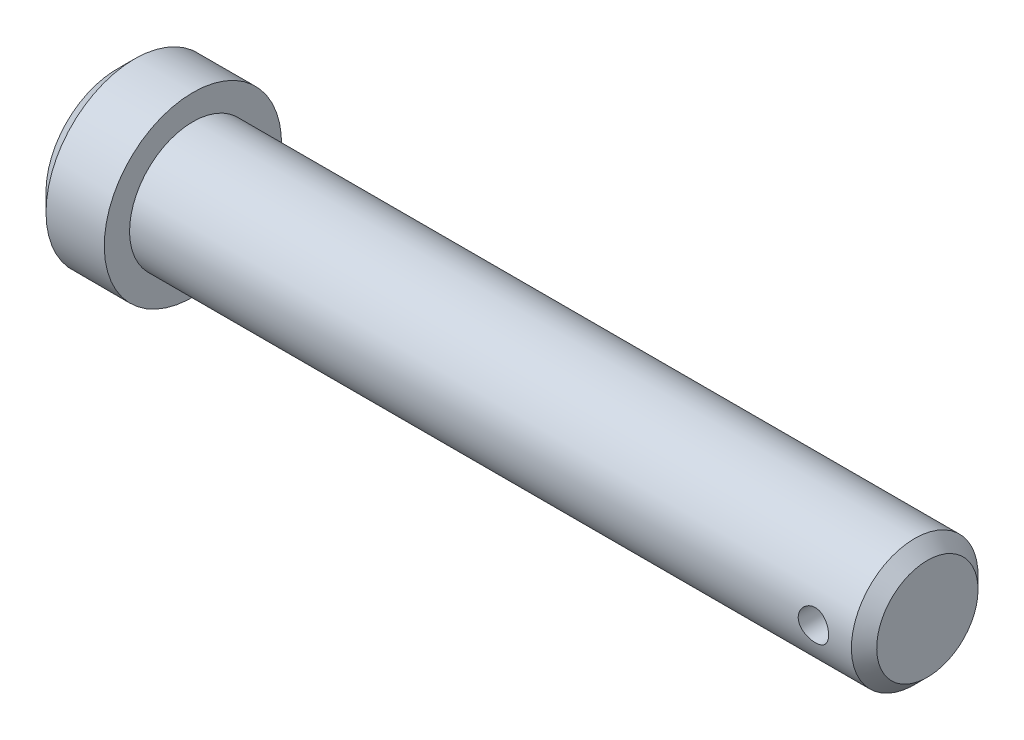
ISO-10303-21;
HEADER;
FILE_DESCRIPTION(('STEP AP214'),'2;1');
FILE_NAME('part.step','',(''),(''),'','','');
FILE_SCHEMA(('AUTOMOTIVE_DESIGN { 1 0 10303 214 1 1 1 1 }'));
ENDSEC;
DATA;
#1=APPLICATION_CONTEXT('core data for automotive mechanical design processes');
#2=APPLICATION_PROTOCOL_DEFINITION('international standard','automotive_design',2000,#1);
#3=PRODUCT_CONTEXT('',#1,'mechanical');
#4=PRODUCT('Part','Part','',(#3));
#5=PRODUCT_RELATED_PRODUCT_CATEGORY('part','',(#4));
#6=PRODUCT_DEFINITION_FORMATION('','',#4);
#7=PRODUCT_DEFINITION_CONTEXT('part definition',#1,'design');
#8=PRODUCT_DEFINITION('design','',#6,#7);
#9=PRODUCT_DEFINITION_SHAPE('','',#8);
#10=(LENGTH_UNIT() NAMED_UNIT(*) SI_UNIT(.MILLI.,.METRE.));
#11=(NAMED_UNIT(*) PLANE_ANGLE_UNIT() SI_UNIT($,.RADIAN.));
#12=(NAMED_UNIT(*) SI_UNIT($,.STERADIAN.) SOLID_ANGLE_UNIT());
#13=UNCERTAINTY_MEASURE_WITH_UNIT(LENGTH_MEASURE(1.E-05),#10,'distance_accuracy_value','');
#14=(GEOMETRIC_REPRESENTATION_CONTEXT(3) GLOBAL_UNCERTAINTY_ASSIGNED_CONTEXT((#13)) GLOBAL_UNIT_ASSIGNED_CONTEXT((#10,
#11,#12)) REPRESENTATION_CONTEXT('',''));
#15=CARTESIAN_POINT('',(0.,0.,0.));
#16=DIRECTION('',(0.,0.,1.));
#17=DIRECTION('',(1.,0.,0.));
#18=AXIS2_PLACEMENT_3D('',#15,#16,#17);
#19=CARTESIAN_POINT('',(0.,0.,0.));
#20=DIRECTION('',(-1.,0.,0.));
#21=DIRECTION('',(0.,-1.,0.));
#22=AXIS2_PLACEMENT_3D('',#19,#20,#21);
#23=PLANE('',#22);
#24=CARTESIAN_POINT('',(0.,0.,0.));
#25=DIRECTION('',(-1.,0.,0.));
#26=DIRECTION('',(0.,-1.,0.));
#27=AXIS2_PLACEMENT_3D('',#24,#25,#26);
#28=CIRCLE('',#27,2.8);
#29=CARTESIAN_POINT('',(0.,-2.80000000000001,0.));
#30=VERTEX_POINT('',#29);
#31=EDGE_CURVE('E45',#30,#30,#28,.T.);
#32=ORIENTED_EDGE('',*,*,#31,.T.);
#33=EDGE_LOOP('',(#32));
#34=FACE_BOUND('',#33,.T.);
#35=ADVANCED_FACE('F34',(#34),#23,.T.);
#36=CARTESIAN_POINT('',(31.9999999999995,-1.99840144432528E-12,-4.44089209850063E-13));
#37=DIRECTION('',(1.,0.,0.));
#38=DIRECTION('',(0.,1.,0.));
#39=AXIS2_PLACEMENT_3D('',#36,#37,#38);
#40=CYLINDRICAL_SURFACE('',#39,3.5);
#41=CARTESIAN_POINT('',(0.699999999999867,-2.44249065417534E-12,-1.11022302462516E-12));
#42=DIRECTION('',(-1.,0.,0.));
#43=DIRECTION('',(0.,-1.,0.));
#44=AXIS2_PLACEMENT_3D('',#41,#42,#43);
#45=CIRCLE('',#44,3.5);
#46=CARTESIAN_POINT('',(0.699999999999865,-3.50000000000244,-1.12168607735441E-12));
#47=VERTEX_POINT('',#46);
#48=EDGE_CURVE('E49',#47,#47,#45,.F.);
#49=ORIENTED_EDGE('',*,*,#48,.T.);
#50=EDGE_LOOP('',(#49));
#51=FACE_BOUND('',#50,.T.);
#52=CARTESIAN_POINT('',(2.99999999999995,-2.33146835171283E-12,-8.88178419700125E-13));
#53=DIRECTION('',(1.,0.,0.));
#54=DIRECTION('',(0.,1.,0.));
#55=AXIS2_PLACEMENT_3D('',#52,#53,#54);
#56=CIRCLE('',#55,3.5);
#57=CARTESIAN_POINT('',(2.99999999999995,3.49999999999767,-8.7671536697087E-13));
#58=VERTEX_POINT('',#57);
#59=EDGE_CURVE('E54',#58,#58,#56,.T.);
#60=ORIENTED_EDGE('',*,*,#59,.F.);
#61=EDGE_LOOP('',(#60));
#62=FACE_BOUND('',#61,.T.);
#63=ADVANCED_FACE('F84',(#51,#62),#40,.T.);
#64=CARTESIAN_POINT('',(2.99999999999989,3.49999999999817,-4.44089209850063E-13));
#65=DIRECTION('',(1.,0.,0.));
#66=DIRECTION('',(0.,1.,0.));
#67=AXIS2_PLACEMENT_3D('',#64,#65,#66);
#68=PLANE('',#67);
#69=ORIENTED_EDGE('',*,*,#59,.T.);
#70=EDGE_LOOP('',(#69));
#71=FACE_BOUND('',#70,.T.);
#72=CARTESIAN_POINT('',(2.99999999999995,-2.33146835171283E-12,-8.88178419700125E-13));
#73=DIRECTION('',(1.,0.,0.));
#74=DIRECTION('',(0.,1.,0.));
#75=AXIS2_PLACEMENT_3D('',#72,#73,#74);
#76=CIRCLE('',#75,2.5);
#77=CARTESIAN_POINT('',(2.99999999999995,2.49999999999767,-8.79990524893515E-13));
#78=VERTEX_POINT('',#77);
#79=EDGE_CURVE('E62',#78,#78,#76,.T.);
#80=ORIENTED_EDGE('',*,*,#79,.F.);
#81=EDGE_LOOP('',(#80));
#82=FACE_BOUND('',#81,.T.);
#83=ADVANCED_FACE('F82',(#71,#82),#68,.T.);
#84=CARTESIAN_POINT('',(31.9999999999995,-1.99840144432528E-12,-4.44089209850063E-13));
#85=DIRECTION('',(1.,0.,0.));
#86=DIRECTION('',(0.,1.,0.));
#87=AXIS2_PLACEMENT_3D('',#84,#85,#86);
#88=CYLINDRICAL_SURFACE('',#87,2.5);
#89=CARTESIAN_POINT('',(31.4999999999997,-1.22124532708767E-12,-2.22044604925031E-13));
#90=DIRECTION('',(1.,0.,0.));
#91=DIRECTION('',(0.,1.,0.));
#92=AXIS2_PLACEMENT_3D('',#89,#90,#91);
#93=CIRCLE('',#92,2.5);
#94=CARTESIAN_POINT('',(31.4999999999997,2.49999999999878,-2.13856710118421E-13));
#95=VERTEX_POINT('',#94);
#96=EDGE_CURVE('E10',#95,#95,#93,.F.);
#97=ORIENTED_EDGE('',*,*,#96,.T.);
#98=EDGE_LOOP('',(#97));
#99=FACE_BOUND('',#98,.T.);
#100=CARTESIAN_POINT('',(30.6000000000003,-1.4432899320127E-12,-2.4999999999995));
#101=CARTESIAN_POINT('',(30.5999989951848,-0.033192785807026,-2.49999941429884));
#102=CARTESIAN_POINT('',(30.597236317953,-0.0663970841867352,-2.49933231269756));
#103=CARTESIAN_POINT('',(30.586273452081,-0.13185685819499,-2.49673567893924));
#104=CARTESIAN_POINT('',(30.5780699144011,-0.164111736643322,-2.49480536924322));
#105=CARTESIAN_POINT('',(30.5565015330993,-0.226717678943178,-2.48989646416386));
#106=CARTESIAN_POINT('',(30.5431426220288,-0.257070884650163,-2.48691907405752));
#107=CARTESIAN_POINT('',(30.5116629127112,-0.315105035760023,-2.4802345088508));
#108=CARTESIAN_POINT('',(30.4935420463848,-0.342785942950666,-2.47652732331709));
#109=CARTESIAN_POINT('',(30.4526871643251,-0.395218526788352,-2.46870772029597));
#110=CARTESIAN_POINT('',(30.4298794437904,-0.419911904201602,-2.46458944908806));
#111=CARTESIAN_POINT('',(30.3804562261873,-0.465162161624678,-2.45645148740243));
#112=CARTESIAN_POINT('',(30.3538403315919,-0.485718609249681,-2.45243180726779));
#113=CARTESIAN_POINT('',(30.297110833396,-0.522379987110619,-2.44488759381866));
#114=CARTESIAN_POINT('',(30.2669546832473,-0.538420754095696,-2.44137051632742));
#115=CARTESIAN_POINT('',(30.2042760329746,-0.565183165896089,-2.43531466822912));
#116=CARTESIAN_POINT('',(30.1717538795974,-0.575905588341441,-2.43277575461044));
#117=CARTESIAN_POINT('',(30.1059046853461,-0.591530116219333,-2.42902369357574));
#118=CARTESIAN_POINT('',(30.0726037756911,-0.596536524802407,-2.42778682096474));
#119=CARTESIAN_POINT('',(30.0056135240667,-0.600911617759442,-2.42670779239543));
#120=CARTESIAN_POINT('',(29.9719242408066,-0.600281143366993,-2.42686542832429));
#121=CARTESIAN_POINT('',(29.9059048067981,-0.593483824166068,-2.42853622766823));
#122=CARTESIAN_POINT('',(29.8735610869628,-0.587440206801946,-2.43001921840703));
#123=CARTESIAN_POINT('',(29.8103605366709,-0.570184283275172,-2.43412567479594));
#124=CARTESIAN_POINT('',(29.7795038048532,-0.558971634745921,-2.43674921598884));
#125=CARTESIAN_POINT('',(29.7198174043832,-0.531588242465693,-2.44286953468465));
#126=CARTESIAN_POINT('',(29.6910095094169,-0.515371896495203,-2.44637428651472));
#127=CARTESIAN_POINT('',(29.6364790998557,-0.478473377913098,-2.45385750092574));
#128=CARTESIAN_POINT('',(29.610757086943,-0.457790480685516,-2.45783604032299));
#129=CARTESIAN_POINT('',(29.5624212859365,-0.411902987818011,-2.46594640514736));
#130=CARTESIAN_POINT('',(29.5399065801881,-0.386594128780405,-2.47007951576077));
#131=CARTESIAN_POINT('',(29.499423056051,-0.332511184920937,-2.47793903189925));
#132=CARTESIAN_POINT('',(29.4814543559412,-0.303737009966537,-2.48166542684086));
#133=CARTESIAN_POINT('',(29.4505405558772,-0.243405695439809,-2.48830789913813));
#134=CARTESIAN_POINT('',(29.437610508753,-0.211840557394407,-2.49122154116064));
#135=CARTESIAN_POINT('',(29.417266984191,-0.146899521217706,-2.49589240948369));
#136=CARTESIAN_POINT('',(29.4098525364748,-0.113523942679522,-2.4976498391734));
#137=CARTESIAN_POINT('',(29.4008995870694,-0.0467574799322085,-2.49978055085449));
#138=CARTESIAN_POINT('',(29.3992260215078,-0.0133856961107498,-2.50018564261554));
#139=CARTESIAN_POINT('',(29.4014333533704,0.0531608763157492,-2.49965614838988));
#140=CARTESIAN_POINT('',(29.4053137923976,0.0863356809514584,-2.49872167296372));
#141=CARTESIAN_POINT('',(29.4184073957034,0.151084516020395,-2.49563832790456));
#142=CARTESIAN_POINT('',(29.4275478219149,0.182674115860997,-2.49350603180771));
#143=CARTESIAN_POINT('',(29.4508196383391,0.243870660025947,-2.48826670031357));
#144=CARTESIAN_POINT('',(29.4649515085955,0.273477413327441,-2.48515957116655));
#145=CARTESIAN_POINT('',(29.4980733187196,0.330412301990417,-2.47823820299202));
#146=CARTESIAN_POINT('',(29.5171401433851,0.35769435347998,-2.47441306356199));
#147=CARTESIAN_POINT('',(29.5594913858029,0.408719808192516,-2.46649872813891));
#148=CARTESIAN_POINT('',(29.5827764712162,0.432462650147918,-2.46240949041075));
#149=CARTESIAN_POINT('',(29.6335281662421,0.476284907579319,-2.45431484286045));
#150=CARTESIAN_POINT('',(29.6610770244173,0.496269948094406,-2.45031338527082));
#151=CARTESIAN_POINT('',(29.7192180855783,0.531332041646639,-2.44295077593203));
#152=CARTESIAN_POINT('',(29.7498101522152,0.546409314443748,-2.43958959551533));
#153=CARTESIAN_POINT('',(29.8130025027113,0.571117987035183,-2.43392379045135));
#154=CARTESIAN_POINT('',(29.845589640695,0.580781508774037,-2.43161294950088));
#155=CARTESIAN_POINT('',(29.9119892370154,0.594476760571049,-2.42830145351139));
#156=CARTESIAN_POINT('',(29.945801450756,0.598509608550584,-2.42730053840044));
#157=CARTESIAN_POINT('',(30.0127341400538,0.600774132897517,-2.42674092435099));
#158=CARTESIAN_POINT('',(30.0458492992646,0.599156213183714,-2.42714483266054));
#159=CARTESIAN_POINT('',(30.1113199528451,0.590506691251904,-2.42926352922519));
#160=CARTESIAN_POINT('',(30.1436754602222,0.583475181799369,-2.43097829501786));
#161=CARTESIAN_POINT('',(30.2065595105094,0.564277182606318,-2.43550549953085));
#162=CARTESIAN_POINT('',(30.2370964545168,0.552136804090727,-2.43831235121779));
#163=CARTESIAN_POINT('',(30.2957208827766,0.523086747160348,-2.44470867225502));
#164=CARTESIAN_POINT('',(30.3238080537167,0.506176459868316,-2.44829824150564));
#165=CARTESIAN_POINT('',(30.3774674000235,0.46758601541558,-2.45596386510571));
#166=CARTESIAN_POINT('',(30.4029624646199,0.445800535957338,-2.46004957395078));
#167=CARTESIAN_POINT('',(30.4499839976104,0.398286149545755,-2.46818719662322));
#168=CARTESIAN_POINT('',(30.4715095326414,0.372556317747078,-2.47223910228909));
#169=CARTESIAN_POINT('',(30.5103218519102,0.31737659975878,-2.47993140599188));
#170=CARTESIAN_POINT('',(30.5275336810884,0.287872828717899,-2.48356400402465));
#171=CARTESIAN_POINT('',(30.5567259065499,0.226307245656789,-2.48992761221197));
#172=CARTESIAN_POINT('',(30.5687102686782,0.194247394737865,-2.49265930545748));
#173=CARTESIAN_POINT('',(30.5852077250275,0.135177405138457,-2.4964811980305));
#174=CARTESIAN_POINT('',(30.5907433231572,0.108462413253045,-2.49779198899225));
#175=CARTESIAN_POINT('',(30.5981397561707,0.0545008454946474,-2.49955160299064));
#176=CARTESIAN_POINT('',(30.6000008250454,0.0272543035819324,-2.50000048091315));
#177=CARTESIAN_POINT('',(30.6000000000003,-1.4432899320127E-12,-2.4999999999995));
#178=B_SPLINE_CURVE_WITH_KNOTS('',3,(#100,#101,#102,#103,#104,#105,#106,#107,#108,#109,#110,
#111,#112,#113,#114,#115,#116,#117,#118,#119,#120,#121,#122,#123,#124,#125,#126,#127,#128,#129,
#130,#131,#132,#133,#134,#135,#136,#137,#138,#139,#140,#141,#142,#143,#144,#145,#146,#147,#148,
#149,#150,#151,#152,#153,#154,#155,#156,#157,#158,#159,#160,#161,#162,#163,#164,#165,#166,#167,
#168,#169,#170,#171,#172,#173,#174,#175,#176,#177),.UNSPECIFIED.,.T.,.F.,(4,2,2,2,2,2,2,2,2,2,2,
2,2,2,2,2,2,2,2,2,2,2,2,2,2,2,2,2,2,2,2,2,2,2,2,2,2,2,4),(0.,0.0994785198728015,
0.199018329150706,0.298443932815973,0.39787095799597,0.499001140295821,0.600141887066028,
0.702654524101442,0.80515216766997,0.905747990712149,1.00632880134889,1.10467654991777,
1.20303081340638,1.30230933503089,1.40160397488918,1.50349991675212,1.60539850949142,
1.70759922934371,1.80978196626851,1.90954355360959,2.00929690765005,2.10770287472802,
2.20611830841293,2.30617046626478,2.40623847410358,2.50855649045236,2.6108699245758,
2.71256968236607,2.81424924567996,2.91324330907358,3.01223567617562,3.11072812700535,
3.2092331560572,3.3101168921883,3.41102431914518,3.51357948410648,3.61605670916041,
3.69774284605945,3.77942378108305),.UNSPECIFIED.);
#179=CARTESIAN_POINT('',(30.6000000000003,-1.4432899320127E-12,-2.4999999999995));
#180=VERTEX_POINT('',#179);
#181=EDGE_CURVE('E55',#180,#180,#178,.T.);
#182=ORIENTED_EDGE('',*,*,#181,.F.);
#183=EDGE_LOOP('',(#182));
#184=FACE_BOUND('',#183,.T.);
#185=CARTESIAN_POINT('',(30.6,-2.1094237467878E-12,2.4999999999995));
#186=CARTESIAN_POINT('',(30.5999989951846,0.0331927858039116,2.49999941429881));
#187=CARTESIAN_POINT('',(30.597236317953,0.0663970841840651,2.49933231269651));
#188=CARTESIAN_POINT('',(30.5862734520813,0.131856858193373,2.49673567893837));
#189=CARTESIAN_POINT('',(30.5780699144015,0.164111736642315,2.49480536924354));
#190=CARTESIAN_POINT('',(30.5565015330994,0.226717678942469,2.48989646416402));
#191=CARTESIAN_POINT('',(30.5431426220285,0.257070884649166,2.48691907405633));
#192=CARTESIAN_POINT('',(30.5116629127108,0.315105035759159,2.48023450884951));
#193=CARTESIAN_POINT('',(30.4935420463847,0.34278594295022,2.47652732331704));
#194=CARTESIAN_POINT('',(30.4526871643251,0.395218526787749,2.46870772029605));
#195=CARTESIAN_POINT('',(30.4298794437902,0.419911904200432,2.46458944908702));
#196=CARTESIAN_POINT('',(30.3804562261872,0.465162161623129,2.45645148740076));
#197=CARTESIAN_POINT('',(30.3538403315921,0.485718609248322,2.45243180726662));
#198=CARTESIAN_POINT('',(30.2971108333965,0.522379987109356,2.4448875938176));
#199=CARTESIAN_POINT('',(30.2669546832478,0.538420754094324,2.44137051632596));
#200=CARTESIAN_POINT('',(30.2042760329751,0.565183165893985,2.43531466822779));
#201=CARTESIAN_POINT('',(30.1717538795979,0.575905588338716,2.43277575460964));
#202=CARTESIAN_POINT('',(30.1059046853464,0.591530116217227,2.42902369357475));
#203=CARTESIAN_POINT('',(30.0726037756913,0.596536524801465,2.42778682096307));
#204=CARTESIAN_POINT('',(30.0056135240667,0.600911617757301,2.42670779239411));
#205=CARTESIAN_POINT('',(29.9719242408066,0.600281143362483,2.42686542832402));
#206=CARTESIAN_POINT('',(29.9059048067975,0.593483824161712,2.42853622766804));
#207=CARTESIAN_POINT('',(29.8735610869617,0.587440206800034,2.43001921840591));
#208=CARTESIAN_POINT('',(29.81036053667,0.570184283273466,2.43412567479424));
#209=CARTESIAN_POINT('',(29.7795038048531,0.55897163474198,2.43674921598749));
#210=CARTESIAN_POINT('',(29.7198174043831,0.531588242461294,2.44286953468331));
#211=CARTESIAN_POINT('',(29.6910095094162,0.515371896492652,2.44637428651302));
#212=CARTESIAN_POINT('',(29.6364790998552,0.478473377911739,2.45385750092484));
#213=CARTESIAN_POINT('',(29.6107570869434,0.457790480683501,2.45783604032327));
#214=CARTESIAN_POINT('',(29.5624212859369,0.411902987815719,2.46594640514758));
#215=CARTESIAN_POINT('',(29.5399065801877,0.386594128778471,2.4700795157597));
#216=CARTESIAN_POINT('',(29.4994230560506,0.332511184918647,2.477939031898));
#217=CARTESIAN_POINT('',(29.4814543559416,0.30373700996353,2.48166542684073));
#218=CARTESIAN_POINT('',(29.4505405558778,0.24340569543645,2.48830789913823));
#219=CARTESIAN_POINT('',(29.4376105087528,0.211840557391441,2.49122154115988));
#220=CARTESIAN_POINT('',(29.4172669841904,0.146899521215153,2.4958924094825));
#221=CARTESIAN_POINT('',(29.4098525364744,0.113523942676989,2.49764983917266));
#222=CARTESIAN_POINT('',(29.4008995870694,0.0467574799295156,2.49978055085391));
#223=CARTESIAN_POINT('',(29.3992260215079,0.0133856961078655,2.50018564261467));
#224=CARTESIAN_POINT('',(29.4014333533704,-0.0531608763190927,2.49965614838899));
#225=CARTESIAN_POINT('',(29.4053137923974,-0.0863356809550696,2.49872167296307));
#226=CARTESIAN_POINT('',(29.4184073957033,-0.15108451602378,2.4956383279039));
#227=CARTESIAN_POINT('',(29.4275478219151,-0.182674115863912,2.49350603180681));
#228=CARTESIAN_POINT('',(29.4508196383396,-0.243870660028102,2.48826670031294));
#229=CARTESIAN_POINT('',(29.464951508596,-0.273477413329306,2.48515957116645));
#230=CARTESIAN_POINT('',(29.4980733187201,-0.330412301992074,2.47823820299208));
#231=CARTESIAN_POINT('',(29.5171401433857,-0.357694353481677,2.47441306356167));
#232=CARTESIAN_POINT('',(29.5594913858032,-0.408719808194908,2.46649872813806));
#233=CARTESIAN_POINT('',(29.582776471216,-0.43246265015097,2.46240949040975));
#234=CARTESIAN_POINT('',(29.633528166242,-0.47628490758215,2.45431484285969));
#235=CARTESIAN_POINT('',(29.6610770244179,-0.496269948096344,2.45031338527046));
#236=CARTESIAN_POINT('',(29.719218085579,-0.531332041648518,2.44295077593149));
#237=CARTESIAN_POINT('',(29.7498101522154,-0.546409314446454,2.43958959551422));
#238=CARTESIAN_POINT('',(29.8130025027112,-0.571117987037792,2.43392379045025));
#239=CARTESIAN_POINT('',(29.8455896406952,-0.580781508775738,2.43161294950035));
#240=CARTESIAN_POINT('',(29.9119892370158,-0.594476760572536,2.42830145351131));
#241=CARTESIAN_POINT('',(29.9458014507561,-0.598509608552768,2.42730053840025));
#242=CARTESIAN_POINT('',(30.0127341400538,-0.600774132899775,2.42674092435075));
#243=CARTESIAN_POINT('',(30.0458492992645,-0.599156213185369,2.42714483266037));
#244=CARTESIAN_POINT('',(30.1113199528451,-0.590506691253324,2.42926352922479));
#245=CARTESIAN_POINT('',(30.1436754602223,-0.583475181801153,2.43097829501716));
#246=CARTESIAN_POINT('',(30.2065595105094,-0.564277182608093,2.43550549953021));
#247=CARTESIAN_POINT('',(30.2370964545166,-0.552136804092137,2.43831235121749));
#248=CARTESIAN_POINT('',(30.2957208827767,-0.523086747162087,2.44470867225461));
#249=CARTESIAN_POINT('',(30.3238080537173,-0.506176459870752,2.44829824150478));
#250=CARTESIAN_POINT('',(30.3774674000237,-0.467586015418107,2.45596386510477));
#251=CARTESIAN_POINT('',(30.4029624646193,-0.445800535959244,2.46004957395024));
#252=CARTESIAN_POINT('',(30.44998399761,-0.398286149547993,2.46818719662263));
#253=CARTESIAN_POINT('',(30.4715095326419,-0.37255631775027,2.47223910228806));
#254=CARTESIAN_POINT('',(30.5103218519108,-0.317376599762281,2.47993140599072));
#255=CARTESIAN_POINT('',(30.5275336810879,-0.287872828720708,2.48356400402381));
#256=CARTESIAN_POINT('',(30.5567259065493,-0.226307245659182,2.48992761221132));
#257=CARTESIAN_POINT('',(30.5687102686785,-0.194247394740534,2.49265930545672));
#258=CARTESIAN_POINT('',(30.5852077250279,-0.135177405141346,2.4964811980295));
#259=CARTESIAN_POINT('',(30.5907433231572,-0.108462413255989,2.49779198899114));
#260=CARTESIAN_POINT('',(30.5981397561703,-0.0545008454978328,2.49955160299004));
#261=CARTESIAN_POINT('',(30.6000008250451,-0.0272543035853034,2.50000048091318));
#262=CARTESIAN_POINT('',(30.6,-2.1094237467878E-12,2.4999999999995));
#263=B_SPLINE_CURVE_WITH_KNOTS('',3,(#185,#186,#187,#188,#189,#190,#191,#192,#193,#194,#195,
#196,#197,#198,#199,#200,#201,#202,#203,#204,#205,#206,#207,#208,#209,#210,#211,#212,#213,#214,
#215,#216,#217,#218,#219,#220,#221,#222,#223,#224,#225,#226,#227,#228,#229,#230,#231,#232,#233,
#234,#235,#236,#237,#238,#239,#240,#241,#242,#243,#244,#245,#246,#247,#248,#249,#250,#251,#252,
#253,#254,#255,#256,#257,#258,#259,#260,#261,#262),.UNSPECIFIED.,.T.,.F.,(4,2,2,2,2,2,2,2,2,2,2,
2,2,2,2,2,2,2,2,2,2,2,2,2,2,2,2,2,2,2,2,2,2,2,2,2,2,2,4),(0.,0.0994785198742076,
0.19901832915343,0.298443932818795,0.397870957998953,0.499001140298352,0.600141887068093,
0.702654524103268,0.805152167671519,0.905747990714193,1.00632880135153,1.10467654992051,
1.20303081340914,1.30230933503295,1.40160397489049,1.503499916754,1.60539850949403,
1.70759922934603,1.80978196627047,1.90954355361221,2.0092969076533,2.1077028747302,
2.20611830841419,2.30617046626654,2.4062384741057,2.50855649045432,2.61086992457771,
2.71256968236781,2.81424924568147,2.91324330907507,3.01223567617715,3.11072812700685,
3.20923315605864,3.31011689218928,3.41102431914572,3.51357948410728,3.61605670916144,
3.69774284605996,3.77942378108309),.UNSPECIFIED.);
#264=CARTESIAN_POINT('',(30.6,-2.1094237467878E-12,2.4999999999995));
#265=VERTEX_POINT('',#264);
#266=EDGE_CURVE('E63',#265,#265,#263,.T.);
#267=ORIENTED_EDGE('',*,*,#266,.F.);
#268=EDGE_LOOP('',(#267));
#269=FACE_BOUND('',#268,.T.);
#270=ORIENTED_EDGE('',*,*,#79,.T.);
#271=EDGE_LOOP('',(#270));
#272=FACE_BOUND('',#271,.T.);
#273=ADVANCED_FACE('F67',(#99,#184,#269,#272),#88,.T.);
#274=CARTESIAN_POINT('',(32.0000000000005,2.4999999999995,0.));
#275=DIRECTION('',(1.,0.,0.));
#276=DIRECTION('',(0.,1.,0.));
#277=AXIS2_PLACEMENT_3D('',#274,#275,#276);
#278=PLANE('',#277);
#279=CARTESIAN_POINT('',(31.9999999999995,-1.99840144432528E-12,-4.44089209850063E-13));
#280=DIRECTION('',(1.,0.,0.));
#281=DIRECTION('',(0.,1.,0.));
#282=AXIS2_PLACEMENT_3D('',#279,#280,#281);
#283=CIRCLE('',#282,2.);
#284=CARTESIAN_POINT('',(31.9999999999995,1.999999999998,-4.37538894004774E-13));
#285=VERTEX_POINT('',#284);
#286=EDGE_CURVE('E41',#285,#285,#283,.T.);
#287=ORIENTED_EDGE('',*,*,#286,.T.);
#288=EDGE_LOOP('',(#287));
#289=FACE_BOUND('',#288,.T.);
#290=ADVANCED_FACE('F75',(#289),#278,.T.);
#291=CARTESIAN_POINT('',(30.0000000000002,-7.7715611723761E-13,-3.5000000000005));
#292=DIRECTION('',(0.,0.,1.));
#293=DIRECTION('',(1.,0.,0.));
#294=AXIS2_PLACEMENT_3D('',#291,#292,#293);
#295=CYLINDRICAL_SURFACE('',#294,0.6);
#296=ORIENTED_EDGE('',*,*,#181,.T.);
#297=EDGE_LOOP('',(#296));
#298=FACE_BOUND('',#297,.T.);
#299=ORIENTED_EDGE('',*,*,#266,.T.);
#300=EDGE_LOOP('',(#299));
#301=FACE_BOUND('',#300,.T.);
#302=ADVANCED_FACE('F71',(#298,#301),#295,.F.);
#303=CARTESIAN_POINT('',(0.699999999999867,-2.44249065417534E-12,-1.11022302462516E-12));
#304=DIRECTION('',(1.,0.,0.));
#305=DIRECTION('',(0.,1.,0.));
#306=AXIS2_PLACEMENT_3D('',#303,#304,#305);
#307=CONICAL_SURFACE('',#306,3.5,0.785398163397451);
#308=ORIENTED_EDGE('',*,*,#31,.F.);
#309=EDGE_LOOP('',(#308));
#310=FACE_BOUND('',#309,.T.);
#311=ORIENTED_EDGE('',*,*,#48,.F.);
#312=EDGE_LOOP('',(#311));
#313=FACE_BOUND('',#312,.T.);
#314=ADVANCED_FACE('F74',(#310,#313),#307,.T.);
#315=CARTESIAN_POINT('',(31.9999999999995,-1.99840144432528E-12,-4.44089209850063E-13));
#316=DIRECTION('',(-1.,0.,0.));
#317=DIRECTION('',(0.,-1.,0.));
#318=AXIS2_PLACEMENT_3D('',#315,#316,#317);
#319=CONICAL_SURFACE('',#318,2.,0.785398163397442);
#320=ORIENTED_EDGE('',*,*,#96,.F.);
#321=EDGE_LOOP('',(#320));
#322=FACE_BOUND('',#321,.T.);
#323=ORIENTED_EDGE('',*,*,#286,.F.);
#324=EDGE_LOOP('',(#323));
#325=FACE_BOUND('',#324,.T.);
#326=ADVANCED_FACE('F36',(#322,#325),#319,.T.);
#327=CLOSED_SHELL('',(#35,#63,#83,#273,#290,#302,#314,#326));
#328=MANIFOLD_SOLID_BREP('B2',#327);
#329=ADVANCED_BREP_SHAPE_REPRESENTATION('',(#18,#328),#14);
#330=SHAPE_DEFINITION_REPRESENTATION(#9,#329);
ENDSEC;
END-ISO-10303-21;
